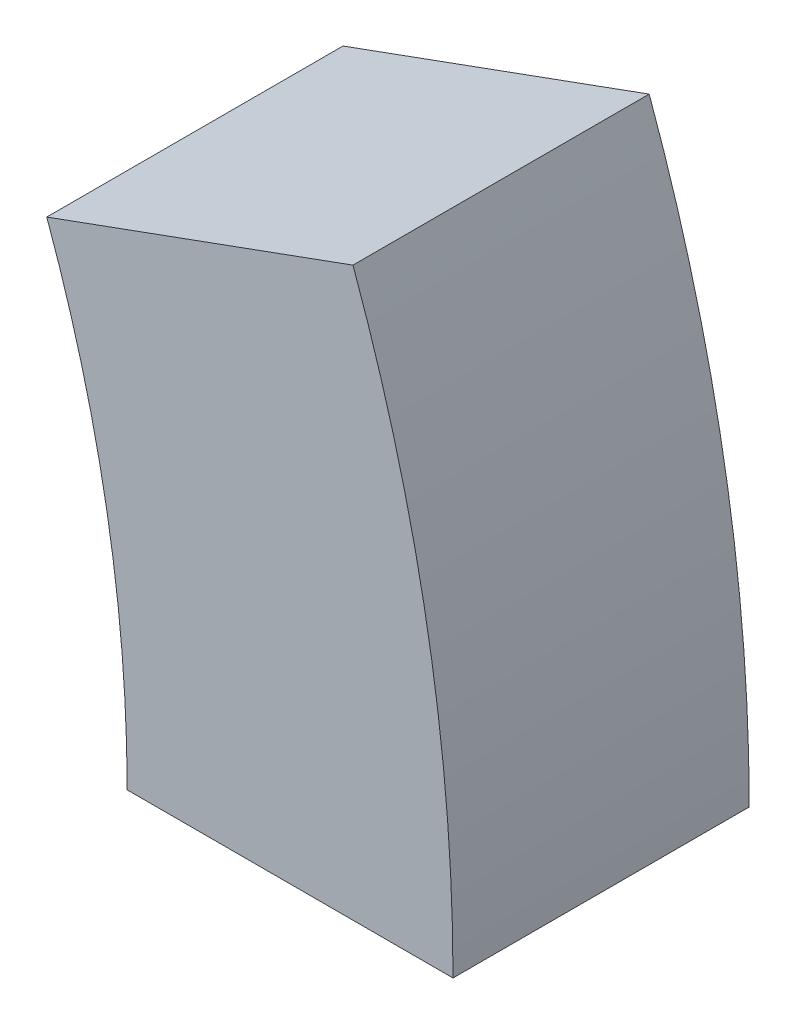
ISO-10303-21;
HEADER;
FILE_DESCRIPTION(('STEP AP214'),'2;1');
FILE_NAME('part.step','',(''),(''),'','','');
FILE_SCHEMA(('AUTOMOTIVE_DESIGN { 1 0 10303 214 1 1 1 1 }'));
ENDSEC;
DATA;
#1=APPLICATION_CONTEXT('core data for automotive mechanical design processes');
#2=APPLICATION_PROTOCOL_DEFINITION('international standard','automotive_design',2000,#1);
#3=PRODUCT_CONTEXT('',#1,'mechanical');
#4=PRODUCT('Part','Part','',(#3));
#5=PRODUCT_RELATED_PRODUCT_CATEGORY('part','',(#4));
#6=PRODUCT_DEFINITION_FORMATION('','',#4);
#7=PRODUCT_DEFINITION_CONTEXT('part definition',#1,'design');
#8=PRODUCT_DEFINITION('design','',#6,#7);
#9=PRODUCT_DEFINITION_SHAPE('','',#8);
#10=(LENGTH_UNIT() NAMED_UNIT(*) SI_UNIT(.MILLI.,.METRE.));
#11=(NAMED_UNIT(*) PLANE_ANGLE_UNIT() SI_UNIT($,.RADIAN.));
#12=(NAMED_UNIT(*) SI_UNIT($,.STERADIAN.) SOLID_ANGLE_UNIT());
#13=UNCERTAINTY_MEASURE_WITH_UNIT(LENGTH_MEASURE(1.E-05),#10,'distance_accuracy_value','');
#14=(GEOMETRIC_REPRESENTATION_CONTEXT(3) GLOBAL_UNCERTAINTY_ASSIGNED_CONTEXT((#13)) GLOBAL_UNIT_ASSIGNED_CONTEXT((#10,
#11,#12)) REPRESENTATION_CONTEXT('',''));
#15=CARTESIAN_POINT('',(0.,0.,0.));
#16=DIRECTION('',(0.,0.,1.));
#17=DIRECTION('',(1.,0.,0.));
#18=AXIS2_PLACEMENT_3D('',#15,#16,#17);
#19=CARTESIAN_POINT('',(0.,0.,20.));
#20=DIRECTION('',(0.,0.,-1.));
#21=DIRECTION('',(-1.,0.,0.));
#22=AXIS2_PLACEMENT_3D('',#19,#20,#21);
#23=CYLINDRICAL_SURFACE('',#22,112.);
#24=CARTESIAN_POINT('',(0.,0.,0.));
#25=DIRECTION('',(0.,0.,1.));
#26=DIRECTION('',(1.,0.,0.));
#27=AXIS2_PLACEMENT_3D('',#24,#25,#26);
#28=CIRCLE('',#27,112.);
#29=CARTESIAN_POINT('',(112.,0.,0.));
#30=VERTEX_POINT('',#29);
#31=CARTESIAN_POINT('',(105.245573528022,38.306256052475,0.));
#32=VERTEX_POINT('',#31);
#33=EDGE_CURVE('E70',#30,#32,#28,.T.);
#34=ORIENTED_EDGE('',*,*,#33,.T.);
#35=DIRECTION('',(0.,0.,-1.));
#36=VECTOR('',#35,1.);
#37=CARTESIAN_POINT('',(105.245573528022,38.306256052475,20.));
#38=LINE('',#37,#36);
#39=CARTESIAN_POINT('',(105.245573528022,38.306256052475,20.));
#40=VERTEX_POINT('',#39);
#41=EDGE_CURVE('E11',#40,#32,#38,.T.);
#42=ORIENTED_EDGE('',*,*,#41,.F.);
#43=CARTESIAN_POINT('',(0.,0.,20.));
#44=DIRECTION('',(0.,0.,1.));
#45=DIRECTION('',(1.,0.,0.));
#46=AXIS2_PLACEMENT_3D('',#43,#44,#45);
#47=CIRCLE('',#46,112.);
#48=CARTESIAN_POINT('',(112.,0.,20.));
#49=VERTEX_POINT('',#48);
#50=EDGE_CURVE('E88',#49,#40,#47,.T.);
#51=ORIENTED_EDGE('',*,*,#50,.F.);
#52=DIRECTION('',(0.,0.,-1.));
#53=VECTOR('',#52,1.);
#54=CARTESIAN_POINT('',(112.,0.,20.));
#55=LINE('',#54,#53);
#56=EDGE_CURVE('E82',#49,#30,#55,.T.);
#57=ORIENTED_EDGE('',*,*,#56,.T.);
#58=EDGE_LOOP('',(#34,#42,#51,#57));
#59=FACE_BOUND('',#58,.T.);
#60=ADVANCED_FACE('F26',(#59),#23,.T.);
#61=CARTESIAN_POINT('',(84.5723358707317,30.7818128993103,20.));
#62=DIRECTION('',(0.342020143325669,-0.939692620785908,0.));
#63=DIRECTION('',(0.939692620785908,0.342020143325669,0.));
#64=AXIS2_PLACEMENT_3D('',#61,#62,#63);
#65=PLANE('',#64);
#66=DIRECTION('',(-0.939692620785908,-0.342020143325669,0.));
#67=VECTOR('',#66,1.);
#68=CARTESIAN_POINT('',(84.5723358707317,30.7818128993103,0.));
#69=LINE('',#68,#67);
#70=CARTESIAN_POINT('',(84.5723358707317,30.7818128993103,0.));
#71=VERTEX_POINT('',#70);
#72=EDGE_CURVE('E66',#32,#71,#69,.T.);
#73=ORIENTED_EDGE('',*,*,#72,.T.);
#74=DIRECTION('',(0.,0.,-1.));
#75=VECTOR('',#74,1.);
#76=CARTESIAN_POINT('',(84.5723358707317,30.7818128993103,20.));
#77=LINE('',#76,#75);
#78=CARTESIAN_POINT('',(84.5723358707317,30.7818128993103,20.));
#79=VERTEX_POINT('',#78);
#80=EDGE_CURVE('E33',#79,#71,#77,.T.);
#81=ORIENTED_EDGE('',*,*,#80,.F.);
#82=DIRECTION('',(-0.939692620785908,-0.342020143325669,0.));
#83=VECTOR('',#82,1.);
#84=CARTESIAN_POINT('',(84.5723358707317,30.7818128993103,20.));
#85=LINE('',#84,#83);
#86=EDGE_CURVE('E78',#40,#79,#85,.T.);
#87=ORIENTED_EDGE('',*,*,#86,.F.);
#88=ORIENTED_EDGE('',*,*,#41,.T.);
#89=EDGE_LOOP('',(#73,#81,#87,#88));
#90=FACE_BOUND('',#89,.T.);
#91=ADVANCED_FACE('F77',(#90),#65,.F.);
#92=CARTESIAN_POINT('',(0.,0.,20.));
#93=DIRECTION('',(0.,0.,-1.));
#94=DIRECTION('',(-1.,0.,0.));
#95=AXIS2_PLACEMENT_3D('',#92,#93,#94);
#96=CYLINDRICAL_SURFACE('',#95,90.);
#97=CARTESIAN_POINT('',(0.,0.,0.));
#98=DIRECTION('',(0.,0.,-1.));
#99=DIRECTION('',(1.,0.,0.));
#100=AXIS2_PLACEMENT_3D('',#97,#98,#99);
#101=CIRCLE('',#100,90.);
#102=CARTESIAN_POINT('',(90.,0.,0.));
#103=VERTEX_POINT('',#102);
#104=EDGE_CURVE('E71',#71,#103,#101,.T.);
#105=ORIENTED_EDGE('',*,*,#104,.T.);
#106=DIRECTION('',(0.,0.,-1.));
#107=VECTOR('',#106,1.);
#108=CARTESIAN_POINT('',(90.,0.,20.));
#109=LINE('',#108,#107);
#110=CARTESIAN_POINT('',(90.,0.,20.));
#111=VERTEX_POINT('',#110);
#112=EDGE_CURVE('E94',#111,#103,#109,.T.);
#113=ORIENTED_EDGE('',*,*,#112,.F.);
#114=CARTESIAN_POINT('',(0.,0.,20.));
#115=DIRECTION('',(0.,0.,-1.));
#116=DIRECTION('',(1.,0.,0.));
#117=AXIS2_PLACEMENT_3D('',#114,#115,#116);
#118=CIRCLE('',#117,90.);
#119=EDGE_CURVE('E45',#79,#111,#118,.T.);
#120=ORIENTED_EDGE('',*,*,#119,.F.);
#121=ORIENTED_EDGE('',*,*,#80,.T.);
#122=EDGE_LOOP('',(#105,#113,#120,#121));
#123=FACE_BOUND('',#122,.T.);
#124=ADVANCED_FACE('F97',(#123),#96,.F.);
#125=CARTESIAN_POINT('',(90.,0.,20.));
#126=DIRECTION('',(0.,1.,0.));
#127=DIRECTION('',(0.,0.,1.));
#128=AXIS2_PLACEMENT_3D('',#125,#126,#127);
#129=PLANE('',#128);
#130=DIRECTION('',(1.,0.,0.));
#131=VECTOR('',#130,1.);
#132=CARTESIAN_POINT('',(90.,0.,0.));
#133=LINE('',#132,#131);
#134=EDGE_CURVE('E86',#103,#30,#133,.T.);
#135=ORIENTED_EDGE('',*,*,#134,.T.);
#136=ORIENTED_EDGE('',*,*,#56,.F.);
#137=DIRECTION('',(1.,0.,0.));
#138=VECTOR('',#137,1.);
#139=CARTESIAN_POINT('',(90.,0.,20.));
#140=LINE('',#139,#138);
#141=EDGE_CURVE('E40',#111,#49,#140,.T.);
#142=ORIENTED_EDGE('',*,*,#141,.F.);
#143=ORIENTED_EDGE('',*,*,#112,.T.);
#144=EDGE_LOOP('',(#135,#136,#142,#143));
#145=FACE_BOUND('',#144,.T.);
#146=ADVANCED_FACE('F99',(#145),#129,.F.);
#147=CARTESIAN_POINT('',(0.,0.,20.));
#148=DIRECTION('',(0.,0.,1.));
#149=DIRECTION('',(1.,0.,0.));
#150=AXIS2_PLACEMENT_3D('',#147,#148,#149);
#151=PLANE('',#150);
#152=ORIENTED_EDGE('',*,*,#50,.T.);
#153=ORIENTED_EDGE('',*,*,#86,.T.);
#154=ORIENTED_EDGE('',*,*,#119,.T.);
#155=ORIENTED_EDGE('',*,*,#141,.T.);
#156=EDGE_LOOP('',(#152,#153,#154,#155));
#157=FACE_BOUND('',#156,.T.);
#158=ADVANCED_FACE('F100',(#157),#151,.T.);
#159=CARTESIAN_POINT('',(0.,0.,0.));
#160=DIRECTION('',(0.,0.,1.));
#161=DIRECTION('',(1.,0.,0.));
#162=AXIS2_PLACEMENT_3D('',#159,#160,#161);
#163=PLANE('',#162);
#164=ORIENTED_EDGE('',*,*,#33,.F.);
#165=ORIENTED_EDGE('',*,*,#134,.F.);
#166=ORIENTED_EDGE('',*,*,#104,.F.);
#167=ORIENTED_EDGE('',*,*,#72,.F.);
#168=EDGE_LOOP('',(#164,#165,#166,#167));
#169=FACE_BOUND('',#168,.T.);
#170=ADVANCED_FACE('F67',(#169),#163,.F.);
#171=CLOSED_SHELL('',(#60,#91,#124,#146,#158,#170));
#172=MANIFOLD_SOLID_BREP('B2',#171);
#173=ADVANCED_BREP_SHAPE_REPRESENTATION('',(#18,#172),#14);
#174=SHAPE_DEFINITION_REPRESENTATION(#9,#173);
ENDSEC;
END-ISO-10303-21;
